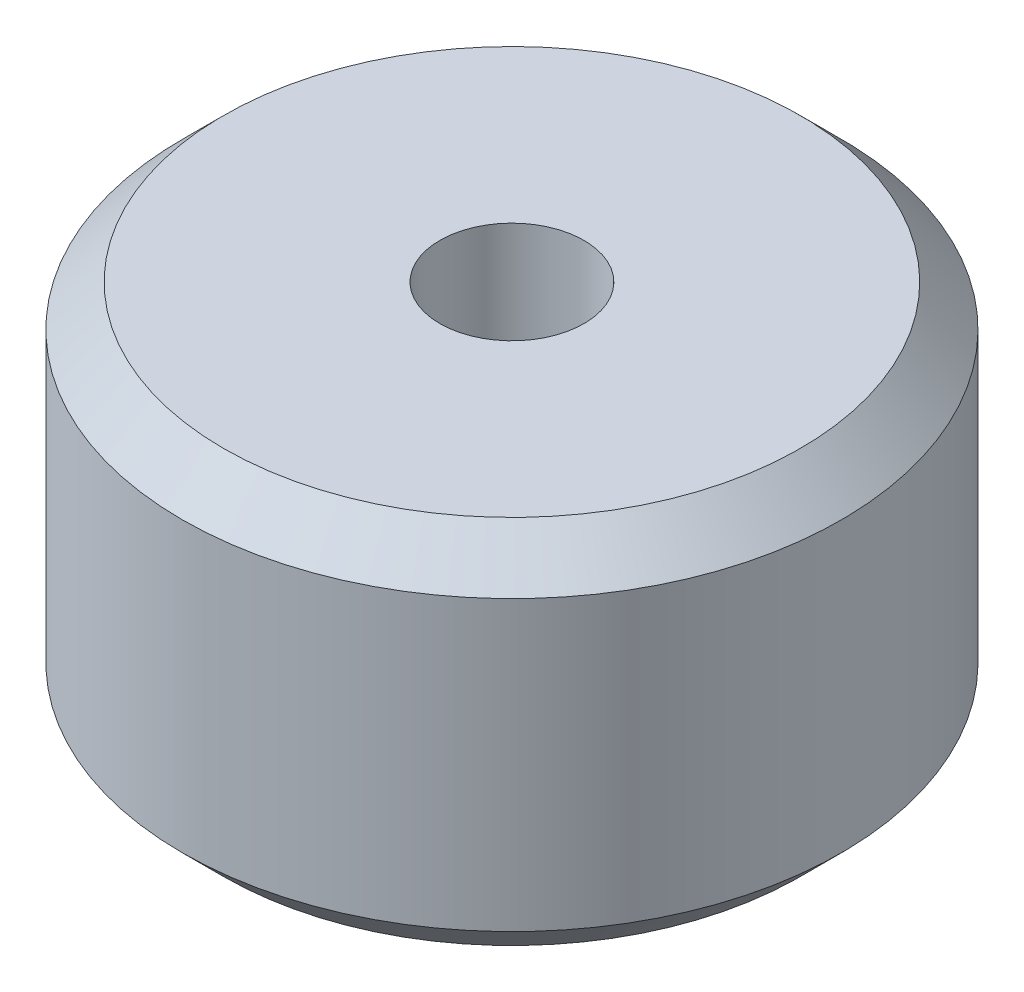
from build123d import *

# Parameters (mm, degrees)
SKETCH1_R      = 8
SKETCH1_R_2    = 1.75
EXTRUDE1_DEPTH = 9
CHAMFER1_SIZE  = 1


with BuildPart() as part:
    # Sketch1 → Extrude1 (new body)
    with BuildSketch(Plane(origin=(0, 0, 0), x_dir=(1, 0, 0), z_dir=(0, 1, 0))):
        with Locations(Location((0, 0, 0), (0, 0, 270))):
            Circle(SKETCH1_R)
        with Locations(Location((0, 0, 0), (0, 0, 270))):
            Circle(SKETCH1_R_2, mode=Mode.SUBTRACT)
    extrude(amount=EXTRUDE1_DEPTH)

    # Chamfer1
    chamfer1_edges = [part.edges().sort_by_distance(p)[0] for p in [
        (0, 0, -8),
        (0, 9, -8),
    ]]
    chamfer(chamfer1_edges, length=CHAMFER1_SIZE)


solid = part.part
